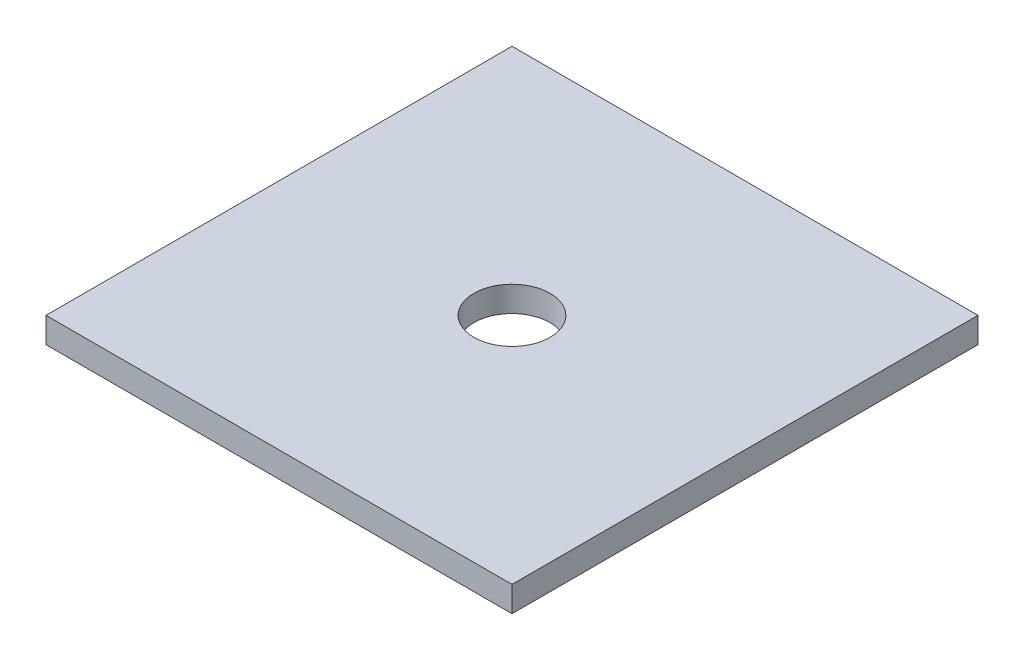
from build123d import *

# Parameters (mm, degrees)
SKETCH1_W      = 55
SKETCH1_H      = 55
SKETCH1_R      = 4.5
EXTRUDE1_DEPTH = 3


with BuildPart() as part:
    # Sketch1 → Extrude1 (new body)
    with BuildSketch(Plane(origin=(0, 0, 0), x_dir=(1, 0, 0), z_dir=(0, 1, 0))):
        with Locations((27.5, 27.5)):
            Rectangle(SKETCH1_W, SKETCH1_H)
        with Locations(Location((27.5, 27.5, 0), (0, 0, 270))):
            Circle(SKETCH1_R, mode=Mode.SUBTRACT)
    extrude(amount=EXTRUDE1_DEPTH)


solid = part.part
